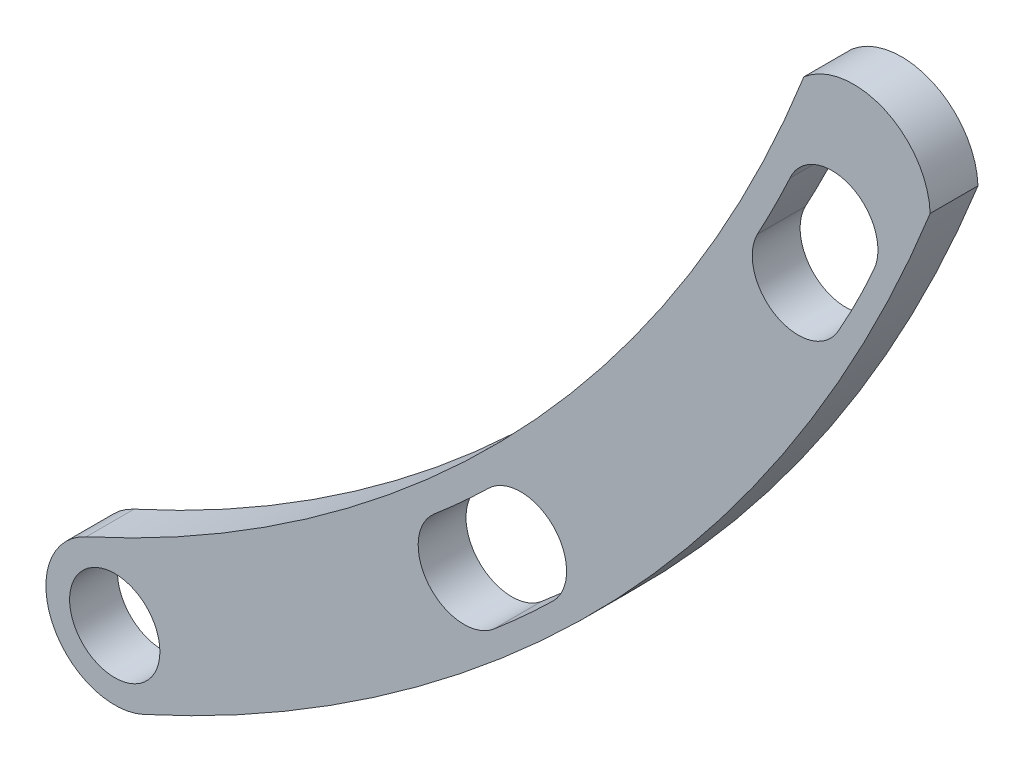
ISO-10303-21;
HEADER;
FILE_DESCRIPTION(('STEP AP214'),'2;1');
FILE_NAME('part.step','',(''),(''),'','','');
FILE_SCHEMA(('AUTOMOTIVE_DESIGN { 1 0 10303 214 1 1 1 1 }'));
ENDSEC;
DATA;
#1=APPLICATION_CONTEXT('core data for automotive mechanical design processes');
#2=APPLICATION_PROTOCOL_DEFINITION('international standard','automotive_design',2000,#1);
#3=PRODUCT_CONTEXT('',#1,'mechanical');
#4=PRODUCT('Part','Part','',(#3));
#5=PRODUCT_RELATED_PRODUCT_CATEGORY('part','',(#4));
#6=PRODUCT_DEFINITION_FORMATION('','',#4);
#7=PRODUCT_DEFINITION_CONTEXT('part definition',#1,'design');
#8=PRODUCT_DEFINITION('design','',#6,#7);
#9=PRODUCT_DEFINITION_SHAPE('','',#8);
#10=(LENGTH_UNIT() NAMED_UNIT(*) SI_UNIT(.MILLI.,.METRE.));
#11=(NAMED_UNIT(*) PLANE_ANGLE_UNIT() SI_UNIT($,.RADIAN.));
#12=(NAMED_UNIT(*) SI_UNIT($,.STERADIAN.) SOLID_ANGLE_UNIT());
#13=UNCERTAINTY_MEASURE_WITH_UNIT(LENGTH_MEASURE(1.E-05),#10,'distance_accuracy_value','');
#14=(GEOMETRIC_REPRESENTATION_CONTEXT(3) GLOBAL_UNCERTAINTY_ASSIGNED_CONTEXT((#13)) GLOBAL_UNIT_ASSIGNED_CONTEXT((#10,
#11,#12)) REPRESENTATION_CONTEXT('',''));
#15=CARTESIAN_POINT('',(0.,0.,0.));
#16=DIRECTION('',(0.,0.,1.));
#17=DIRECTION('',(1.,0.,0.));
#18=AXIS2_PLACEMENT_3D('',#15,#16,#17);
#19=CARTESIAN_POINT('',(-23.9673933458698,3.05846681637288,1.5875));
#20=DIRECTION('',(0.,0.,-1.));
#21=DIRECTION('',(-1.,0.,0.));
#22=AXIS2_PLACEMENT_3D('',#19,#20,#21);
#23=PLANE('',#22);
#24=CARTESIAN_POINT('',(9.8401518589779,4.52408077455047,1.5875));
#25=DIRECTION('',(0.,0.,1.));
#26=DIRECTION('',(-1.,0.,0.));
#27=AXIS2_PLACEMENT_3D('',#24,#25,#26);
#28=CIRCLE('',#27,1.524);
#29=CARTESIAN_POINT('',(11.2366607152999,3.91388489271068,1.5875));
#30=VERTEX_POINT('',#29);
#31=CARTESIAN_POINT('',(8.4436430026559,5.13427665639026,1.5875));
#32=VERTEX_POINT('',#31);
#33=EDGE_CURVE('E161',#30,#32,#28,.T.);
#34=ORIENTED_EDGE('',*,*,#33,.F.);
#35=CARTESIAN_POINT('',(-12.1897846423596,14.1499248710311,1.5875));
#36=DIRECTION('',(0.,0.,1.));
#37=DIRECTION('',(-1.,0.,0.));
#38=AXIS2_PLACEMENT_3D('',#35,#36,#37);
#39=CIRCLE('',#38,25.5651101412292);
#40=CARTESIAN_POINT('',(10.0424112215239,1.52834321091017,1.5875));
#41=VERTEX_POINT('',#40);
#42=EDGE_CURVE('E53',#41,#30,#39,.T.);
#43=ORIENTED_EDGE('',*,*,#42,.F.);
#44=CARTESIAN_POINT('',(8.71709455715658,2.28074718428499,1.5875));
#45=DIRECTION('',(0.,0.,1.));
#46=DIRECTION('',(-1.,0.,0.));
#47=AXIS2_PLACEMENT_3D('',#44,#45,#46);
#48=CIRCLE('',#47,1.524);
#49=CARTESIAN_POINT('',(7.36303274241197,2.98009874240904,1.5875));
#50=VERTEX_POINT('',#49);
#51=EDGE_CURVE('E169',#50,#41,#48,.T.);
#52=ORIENTED_EDGE('',*,*,#51,.F.);
#53=CARTESIAN_POINT('',(-26.1800502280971,21.1545957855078,1.5875));
#54=DIRECTION('',(0.,0.,-1.));
#55=DIRECTION('',(1.,0.,0.));
#56=AXIS2_PLACEMENT_3D('',#53,#54,#55);
#57=CIRCLE('',#56,38.1503703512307);
#58=EDGE_CURVE('E181',#32,#50,#57,.T.);
#59=ORIENTED_EDGE('',*,*,#58,.F.);
#60=EDGE_LOOP('',(#34,#43,#52,#59));
#61=FACE_BOUND('',#60,.T.);
#62=CARTESIAN_POINT('',(-2.3735252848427,-11.5836037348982,1.5875));
#63=DIRECTION('',(0.,0.,1.));
#64=DIRECTION('',(1.,0.,0.));
#65=AXIS2_PLACEMENT_3D('',#62,#63,#64);
#66=CIRCLE('',#65,1.524);
#67=CARTESIAN_POINT('',(-3.35924509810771,-10.4213075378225,1.5875));
#68=VERTEX_POINT('',#67);
#69=CARTESIAN_POINT('',(-1.3878054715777,-12.745899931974,1.5875));
#70=VERTEX_POINT('',#69);
#71=EDGE_CURVE('E209',#68,#70,#66,.T.);
#72=ORIENTED_EDGE('',*,*,#71,.F.);
#73=CARTESIAN_POINT('',(-26.2307560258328,16.5472790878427,1.5875));
#74=DIRECTION('',(0.,0.,-1.));
#75=DIRECTION('',(1.,0.,0.));
#76=AXIS2_PLACEMENT_3D('',#73,#74,#75);
#77=CIRCLE('',#76,35.3611464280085);
#78=CARTESIAN_POINT('',(-1.5580122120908,-8.78385569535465,1.5875));
#79=VERTEX_POINT('',#78);
#80=EDGE_CURVE('E188',#79,#68,#77,.T.);
#81=ORIENTED_EDGE('',*,*,#80,.F.);
#82=CARTESIAN_POINT('',(-0.494662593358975,-9.8755807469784,1.5875));
#83=DIRECTION('',(0.,0.,1.));
#84=DIRECTION('',(1.,0.,0.));
#85=AXIS2_PLACEMENT_3D('',#82,#83,#84);
#86=CIRCLE('',#85,1.524);
#87=CARTESIAN_POINT('',(0.568687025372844,-10.9673057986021,1.5875));
#88=VERTEX_POINT('',#87);
#89=EDGE_CURVE('E198',#88,#79,#86,.T.);
#90=ORIENTED_EDGE('',*,*,#89,.F.);
#91=CARTESIAN_POINT('',(-26.2307560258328,16.5472790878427,1.5875));
#92=DIRECTION('',(0.,0.,1.));
#93=DIRECTION('',(-1.,0.,0.));
#94=AXIS2_PLACEMENT_3D('',#91,#92,#93);
#95=CIRCLE('',#94,38.4091464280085);
#96=EDGE_CURVE('E212',#70,#88,#95,.T.);
#97=ORIENTED_EDGE('',*,*,#96,.F.);
#98=EDGE_LOOP('',(#72,#81,#90,#97));
#99=FACE_BOUND('',#98,.T.);
#100=CARTESIAN_POINT('',(-33.9647866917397,25.0548821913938,1.5875));
#101=DIRECTION('',(0.,0.,1.));
#102=DIRECTION('',(-1.,0.,0.));
#103=AXIS2_PLACEMENT_3D('',#100,#101,#102);
#104=CIRCLE('',#103,50.6095);
#105=CARTESIAN_POINT('',(-13.0241230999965,-21.0190811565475,1.5875));
#106=VERTEX_POINT('',#105);
#107=CARTESIAN_POINT('',(13.0991355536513,6.44551054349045,1.5875));
#108=VERTEX_POINT('',#107);
#109=EDGE_CURVE('E131',#106,#108,#104,.T.);
#110=ORIENTED_EDGE('',*,*,#109,.T.);
#111=CARTESIAN_POINT('',(10.5609319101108,6.35,1.5875));
#112=DIRECTION('',(0.,0.,1.));
#113=DIRECTION('',(1.,0.,0.));
#114=AXIS2_PLACEMENT_3D('',#111,#112,#113);
#115=CIRCLE('',#114,2.54);
#116=CARTESIAN_POINT('',(8.90679250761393,8.27754321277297,1.5875));
#117=VERTEX_POINT('',#116);
#118=EDGE_CURVE('E45',#108,#117,#115,.T.);
#119=ORIENTED_EDGE('',*,*,#118,.T.);
#120=CARTESIAN_POINT('',(-33.9647866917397,25.0548821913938,1.5875));
#121=DIRECTION('',(0.,0.,-1.));
#122=DIRECTION('',(-1.,0.,0.));
#123=AXIS2_PLACEMENT_3D('',#120,#121,#122);
#124=CIRCLE('',#123,46.0375);
#125=CARTESIAN_POINT('',(-14.9158769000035,-16.8568159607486,1.5875));
#126=VERTEX_POINT('',#125);
#127=EDGE_CURVE('E128',#117,#126,#124,.T.);
#128=ORIENTED_EDGE('',*,*,#127,.T.);
#129=CARTESIAN_POINT('',(-13.97,-18.9379485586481,1.5875));
#130=DIRECTION('',(0.,0.,1.));
#131=DIRECTION('',(1.,0.,0.));
#132=AXIS2_PLACEMENT_3D('',#129,#130,#131);
#133=CIRCLE('',#132,2.286);
#134=EDGE_CURVE('E135',#126,#106,#133,.T.);
#135=ORIENTED_EDGE('',*,*,#134,.T.);
#136=EDGE_LOOP('',(#110,#119,#128,#135));
#137=FACE_BOUND('',#136,.T.);
#138=CARTESIAN_POINT('',(-13.97,-18.9379485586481,1.5875));
#139=DIRECTION('',(0.,0.,1.));
#140=DIRECTION('',(1.,0.,0.));
#141=AXIS2_PLACEMENT_3D('',#138,#139,#140);
#142=CIRCLE('',#141,1.4986);
#143=CARTESIAN_POINT('',(-12.4714,-18.9379485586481,1.5875));
#144=VERTEX_POINT('',#143);
#145=EDGE_CURVE('E149',#144,#144,#142,.T.);
#146=ORIENTED_EDGE('',*,*,#145,.F.);
#147=EDGE_LOOP('',(#146));
#148=FACE_BOUND('',#147,.T.);
#149=ADVANCED_FACE('F30',(#61,#99,#137,#148),#23,.F.);
#150=CARTESIAN_POINT('',(-23.9673933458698,3.05846681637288,0.));
#151=DIRECTION('',(0.,0.,-1.));
#152=DIRECTION('',(-1.,0.,0.));
#153=AXIS2_PLACEMENT_3D('',#150,#151,#152);
#154=PLANE('',#153);
#155=CARTESIAN_POINT('',(10.5609319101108,6.35,0.));
#156=DIRECTION('',(0.,0.,-1.));
#157=DIRECTION('',(-1.,0.,0.));
#158=AXIS2_PLACEMENT_3D('',#155,#156,#157);
#159=CIRCLE('',#158,2.54);
#160=CARTESIAN_POINT('',(13.0991355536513,6.44551054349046,0.));
#161=VERTEX_POINT('',#160);
#162=CARTESIAN_POINT('',(8.90679250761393,8.27754321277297,0.));
#163=VERTEX_POINT('',#162);
#164=EDGE_CURVE('E120',#161,#163,#159,.F.);
#165=ORIENTED_EDGE('',*,*,#164,.F.);
#166=CARTESIAN_POINT('',(-33.9647866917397,25.0548821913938,0.));
#167=DIRECTION('',(0.,0.,1.));
#168=DIRECTION('',(-1.,0.,0.));
#169=AXIS2_PLACEMENT_3D('',#166,#167,#168);
#170=CIRCLE('',#169,50.6095);
#171=CARTESIAN_POINT('',(-13.0241230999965,-21.0190811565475,0.));
#172=VERTEX_POINT('',#171);
#173=EDGE_CURVE('E136',#172,#161,#170,.T.);
#174=ORIENTED_EDGE('',*,*,#173,.F.);
#175=CARTESIAN_POINT('',(-13.97,-18.9379485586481,0.));
#176=DIRECTION('',(0.,0.,1.));
#177=DIRECTION('',(1.,0.,0.));
#178=AXIS2_PLACEMENT_3D('',#175,#176,#177);
#179=CIRCLE('',#178,2.286);
#180=CARTESIAN_POINT('',(-14.9158769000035,-16.8568159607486,0.));
#181=VERTEX_POINT('',#180);
#182=EDGE_CURVE('E140',#181,#172,#179,.T.);
#183=ORIENTED_EDGE('',*,*,#182,.F.);
#184=CARTESIAN_POINT('',(-33.9647866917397,25.0548821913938,0.));
#185=DIRECTION('',(0.,0.,-1.));
#186=DIRECTION('',(-1.,0.,0.));
#187=AXIS2_PLACEMENT_3D('',#184,#185,#186);
#188=CIRCLE('',#187,46.0375);
#189=EDGE_CURVE('E147',#163,#181,#188,.T.);
#190=ORIENTED_EDGE('',*,*,#189,.F.);
#191=EDGE_LOOP('',(#165,#174,#183,#190));
#192=FACE_BOUND('',#191,.T.);
#193=CARTESIAN_POINT('',(-12.1897846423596,14.1499248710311,0.));
#194=DIRECTION('',(0.,0.,1.));
#195=DIRECTION('',(-1.,0.,0.));
#196=AXIS2_PLACEMENT_3D('',#193,#194,#195);
#197=CIRCLE('',#196,25.5651101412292);
#198=CARTESIAN_POINT('',(10.0424112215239,1.52834321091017,0.));
#199=VERTEX_POINT('',#198);
#200=CARTESIAN_POINT('',(11.2366607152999,3.91388489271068,0.));
#201=VERTEX_POINT('',#200);
#202=EDGE_CURVE('E165',#199,#201,#197,.T.);
#203=ORIENTED_EDGE('',*,*,#202,.T.);
#204=CARTESIAN_POINT('',(9.8401518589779,4.52408077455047,0.));
#205=DIRECTION('',(0.,0.,1.));
#206=DIRECTION('',(-1.,0.,0.));
#207=AXIS2_PLACEMENT_3D('',#204,#205,#206);
#208=CIRCLE('',#207,1.524);
#209=CARTESIAN_POINT('',(8.4436430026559,5.13427665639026,0.));
#210=VERTEX_POINT('',#209);
#211=EDGE_CURVE('E168',#201,#210,#208,.T.);
#212=ORIENTED_EDGE('',*,*,#211,.T.);
#213=CARTESIAN_POINT('',(-26.1800502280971,21.1545957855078,0.));
#214=DIRECTION('',(0.,0.,-1.));
#215=DIRECTION('',(1.,0.,0.));
#216=AXIS2_PLACEMENT_3D('',#213,#214,#215);
#217=CIRCLE('',#216,38.1503703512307);
#218=CARTESIAN_POINT('',(7.36303274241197,2.98009874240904,0.));
#219=VERTEX_POINT('',#218);
#220=EDGE_CURVE('E172',#210,#219,#217,.T.);
#221=ORIENTED_EDGE('',*,*,#220,.T.);
#222=CARTESIAN_POINT('',(8.71709455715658,2.28074718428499,0.));
#223=DIRECTION('',(0.,0.,1.));
#224=DIRECTION('',(-1.,0.,0.));
#225=AXIS2_PLACEMENT_3D('',#222,#223,#224);
#226=CIRCLE('',#225,1.524);
#227=EDGE_CURVE('E175',#219,#199,#226,.T.);
#228=ORIENTED_EDGE('',*,*,#227,.T.);
#229=EDGE_LOOP('',(#203,#212,#221,#228));
#230=FACE_BOUND('',#229,.T.);
#231=CARTESIAN_POINT('',(-26.2307560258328,16.5472790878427,0.));
#232=DIRECTION('',(0.,0.,-1.));
#233=DIRECTION('',(1.,0.,0.));
#234=AXIS2_PLACEMENT_3D('',#231,#232,#233);
#235=CIRCLE('',#234,35.3611464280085);
#236=CARTESIAN_POINT('',(-1.5580122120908,-8.78385569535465,0.));
#237=VERTEX_POINT('',#236);
#238=CARTESIAN_POINT('',(-3.35924509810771,-10.4213075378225,0.));
#239=VERTEX_POINT('',#238);
#240=EDGE_CURVE('E194',#237,#239,#235,.T.);
#241=ORIENTED_EDGE('',*,*,#240,.T.);
#242=CARTESIAN_POINT('',(-2.3735252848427,-11.5836037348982,0.));
#243=DIRECTION('',(0.,0.,1.));
#244=DIRECTION('',(1.,0.,0.));
#245=AXIS2_PLACEMENT_3D('',#242,#243,#244);
#246=CIRCLE('',#245,1.524);
#247=CARTESIAN_POINT('',(-1.3878054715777,-12.745899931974,0.));
#248=VERTEX_POINT('',#247);
#249=EDGE_CURVE('E197',#239,#248,#246,.T.);
#250=ORIENTED_EDGE('',*,*,#249,.T.);
#251=CARTESIAN_POINT('',(-26.2307560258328,16.5472790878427,0.));
#252=DIRECTION('',(0.,0.,1.));
#253=DIRECTION('',(-1.,0.,0.));
#254=AXIS2_PLACEMENT_3D('',#251,#252,#253);
#255=CIRCLE('',#254,38.4091464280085);
#256=CARTESIAN_POINT('',(0.568687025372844,-10.9673057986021,0.));
#257=VERTEX_POINT('',#256);
#258=EDGE_CURVE('E201',#248,#257,#255,.T.);
#259=ORIENTED_EDGE('',*,*,#258,.T.);
#260=CARTESIAN_POINT('',(-0.494662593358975,-9.8755807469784,0.));
#261=DIRECTION('',(0.,0.,1.));
#262=DIRECTION('',(1.,0.,0.));
#263=AXIS2_PLACEMENT_3D('',#260,#261,#262);
#264=CIRCLE('',#263,1.524);
#265=EDGE_CURVE('E204',#257,#237,#264,.T.);
#266=ORIENTED_EDGE('',*,*,#265,.T.);
#267=EDGE_LOOP('',(#241,#250,#259,#266));
#268=FACE_BOUND('',#267,.T.);
#269=CARTESIAN_POINT('',(-13.97,-18.9379485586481,0.));
#270=DIRECTION('',(0.,0.,1.));
#271=DIRECTION('',(1.,0.,0.));
#272=AXIS2_PLACEMENT_3D('',#269,#270,#271);
#273=CIRCLE('',#272,1.4986);
#274=CARTESIAN_POINT('',(-12.4714,-18.9379485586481,0.));
#275=VERTEX_POINT('',#274);
#276=EDGE_CURVE('E143',#275,#275,#273,.T.);
#277=ORIENTED_EDGE('',*,*,#276,.T.);
#278=EDGE_LOOP('',(#277));
#279=FACE_BOUND('',#278,.T.);
#280=ADVANCED_FACE('F158',(#192,#230,#268,#279),#154,.T.);
#281=CARTESIAN_POINT('',(-33.9647866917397,25.0548821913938,1.5875));
#282=DIRECTION('',(0.,0.,-1.));
#283=DIRECTION('',(-1.,0.,0.));
#284=AXIS2_PLACEMENT_3D('',#281,#282,#283);
#285=CYLINDRICAL_SURFACE('',#284,46.0375);
#286=ORIENTED_EDGE('',*,*,#127,.F.);
#287=DIRECTION('',(0.,0.,-1.));
#288=VECTOR('',#287,1.);
#289=CARTESIAN_POINT('',(8.90679250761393,8.27754321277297,1.5875));
#290=LINE('',#289,#288);
#291=EDGE_CURVE('E117',#117,#163,#290,.T.);
#292=ORIENTED_EDGE('',*,*,#291,.T.);
#293=ORIENTED_EDGE('',*,*,#189,.T.);
#294=DIRECTION('',(0.,0.,-1.));
#295=VECTOR('',#294,1.);
#296=CARTESIAN_POINT('',(-14.9158769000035,-16.8568159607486,1.5875));
#297=LINE('',#296,#295);
#298=EDGE_CURVE('E11',#126,#181,#297,.T.);
#299=ORIENTED_EDGE('',*,*,#298,.F.);
#300=EDGE_LOOP('',(#286,#292,#293,#299));
#301=FACE_BOUND('',#300,.T.);
#302=ADVANCED_FACE('F32',(#301),#285,.F.);
#303=CARTESIAN_POINT('',(-13.97,-18.9379485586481,1.5875));
#304=DIRECTION('',(0.,0.,-1.));
#305=DIRECTION('',(-1.,0.,0.));
#306=AXIS2_PLACEMENT_3D('',#303,#304,#305);
#307=CYLINDRICAL_SURFACE('',#306,2.286);
#308=ORIENTED_EDGE('',*,*,#182,.T.);
#309=DIRECTION('',(0.,0.,-1.));
#310=VECTOR('',#309,1.);
#311=CARTESIAN_POINT('',(-13.0241230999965,-21.0190811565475,1.5875));
#312=LINE('',#311,#310);
#313=EDGE_CURVE('E38',#106,#172,#312,.T.);
#314=ORIENTED_EDGE('',*,*,#313,.F.);
#315=ORIENTED_EDGE('',*,*,#134,.F.);
#316=ORIENTED_EDGE('',*,*,#298,.T.);
#317=EDGE_LOOP('',(#308,#314,#315,#316));
#318=FACE_BOUND('',#317,.T.);
#319=ADVANCED_FACE('F242',(#318),#307,.T.);
#320=CARTESIAN_POINT('',(-33.9647866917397,25.0548821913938,1.5875));
#321=DIRECTION('',(0.,0.,-1.));
#322=DIRECTION('',(-1.,0.,0.));
#323=AXIS2_PLACEMENT_3D('',#320,#321,#322);
#324=CYLINDRICAL_SURFACE('',#323,50.6095);
#325=ORIENTED_EDGE('',*,*,#173,.T.);
#326=DIRECTION('',(0.,0.,-1.));
#327=VECTOR('',#326,1.);
#328=CARTESIAN_POINT('',(13.0991355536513,6.44551054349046,1.5875));
#329=LINE('',#328,#327);
#330=EDGE_CURVE('E132',#108,#161,#329,.T.);
#331=ORIENTED_EDGE('',*,*,#330,.F.);
#332=ORIENTED_EDGE('',*,*,#109,.F.);
#333=ORIENTED_EDGE('',*,*,#313,.T.);
#334=EDGE_LOOP('',(#325,#331,#332,#333));
#335=FACE_BOUND('',#334,.T.);
#336=ADVANCED_FACE('F154',(#335),#324,.T.);
#337=CARTESIAN_POINT('',(-13.97,-18.9379485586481,1.5875));
#338=DIRECTION('',(0.,0.,-1.));
#339=DIRECTION('',(-1.,0.,0.));
#340=AXIS2_PLACEMENT_3D('',#337,#338,#339);
#341=CYLINDRICAL_SURFACE('',#340,1.4986);
#342=ORIENTED_EDGE('',*,*,#145,.T.);
#343=EDGE_LOOP('',(#342));
#344=FACE_BOUND('',#343,.T.);
#345=ORIENTED_EDGE('',*,*,#276,.F.);
#346=EDGE_LOOP('',(#345));
#347=FACE_BOUND('',#346,.T.);
#348=ADVANCED_FACE('F231',(#344,#347),#341,.F.);
#349=CARTESIAN_POINT('',(-26.2307560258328,16.5472790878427,0.));
#350=DIRECTION('',(0.,0.,1.));
#351=DIRECTION('',(1.,0.,0.));
#352=AXIS2_PLACEMENT_3D('',#349,#350,#351);
#353=CYLINDRICAL_SURFACE('',#352,35.3611464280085);
#354=ORIENTED_EDGE('',*,*,#80,.T.);
#355=DIRECTION('',(0.,0.,1.));
#356=VECTOR('',#355,1.);
#357=CARTESIAN_POINT('',(-3.35924509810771,-10.4213075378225,0.));
#358=LINE('',#357,#356);
#359=EDGE_CURVE('E207',#239,#68,#358,.T.);
#360=ORIENTED_EDGE('',*,*,#359,.F.);
#361=ORIENTED_EDGE('',*,*,#240,.F.);
#362=DIRECTION('',(0.,0.,1.));
#363=VECTOR('',#362,1.);
#364=CARTESIAN_POINT('',(-1.5580122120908,-8.78385569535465,0.));
#365=LINE('',#364,#363);
#366=EDGE_CURVE('E217',#237,#79,#365,.T.);
#367=ORIENTED_EDGE('',*,*,#366,.T.);
#368=EDGE_LOOP('',(#354,#360,#361,#367));
#369=FACE_BOUND('',#368,.T.);
#370=ADVANCED_FACE('F233',(#369),#353,.T.);
#371=CARTESIAN_POINT('',(-0.494662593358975,-9.8755807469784,0.));
#372=DIRECTION('',(0.,0.,1.));
#373=DIRECTION('',(1.,0.,0.));
#374=AXIS2_PLACEMENT_3D('',#371,#372,#373);
#375=CYLINDRICAL_SURFACE('',#374,1.524);
#376=ORIENTED_EDGE('',*,*,#89,.T.);
#377=ORIENTED_EDGE('',*,*,#366,.F.);
#378=ORIENTED_EDGE('',*,*,#265,.F.);
#379=DIRECTION('',(0.,0.,1.));
#380=VECTOR('',#379,1.);
#381=CARTESIAN_POINT('',(0.568687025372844,-10.9673057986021,0.));
#382=LINE('',#381,#380);
#383=EDGE_CURVE('E219',#257,#88,#382,.T.);
#384=ORIENTED_EDGE('',*,*,#383,.T.);
#385=EDGE_LOOP('',(#376,#377,#378,#384));
#386=FACE_BOUND('',#385,.T.);
#387=ADVANCED_FACE('F239',(#386),#375,.F.);
#388=CARTESIAN_POINT('',(-26.2307560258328,16.5472790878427,0.));
#389=DIRECTION('',(0.,0.,1.));
#390=DIRECTION('',(1.,0.,0.));
#391=AXIS2_PLACEMENT_3D('',#388,#389,#390);
#392=CYLINDRICAL_SURFACE('',#391,38.4091464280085);
#393=ORIENTED_EDGE('',*,*,#96,.T.);
#394=ORIENTED_EDGE('',*,*,#383,.F.);
#395=ORIENTED_EDGE('',*,*,#258,.F.);
#396=DIRECTION('',(0.,0.,1.));
#397=VECTOR('',#396,1.);
#398=CARTESIAN_POINT('',(-1.3878054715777,-12.745899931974,0.));
#399=LINE('',#398,#397);
#400=EDGE_CURVE('E221',#248,#70,#399,.T.);
#401=ORIENTED_EDGE('',*,*,#400,.T.);
#402=EDGE_LOOP('',(#393,#394,#395,#401));
#403=FACE_BOUND('',#402,.T.);
#404=ADVANCED_FACE('F319',(#403),#392,.F.);
#405=CARTESIAN_POINT('',(-2.3735252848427,-11.5836037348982,0.));
#406=DIRECTION('',(0.,0.,1.));
#407=DIRECTION('',(1.,0.,0.));
#408=AXIS2_PLACEMENT_3D('',#405,#406,#407);
#409=CYLINDRICAL_SURFACE('',#408,1.524);
#410=ORIENTED_EDGE('',*,*,#71,.T.);
#411=ORIENTED_EDGE('',*,*,#400,.F.);
#412=ORIENTED_EDGE('',*,*,#249,.F.);
#413=ORIENTED_EDGE('',*,*,#359,.T.);
#414=EDGE_LOOP('',(#410,#411,#412,#413));
#415=FACE_BOUND('',#414,.T.);
#416=ADVANCED_FACE('F310',(#415),#409,.F.);
#417=CARTESIAN_POINT('',(-12.1897846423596,14.1499248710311,0.));
#418=DIRECTION('',(0.,0.,1.));
#419=DIRECTION('',(1.,0.,0.));
#420=AXIS2_PLACEMENT_3D('',#417,#418,#419);
#421=CYLINDRICAL_SURFACE('',#420,25.5651101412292);
#422=ORIENTED_EDGE('',*,*,#42,.T.);
#423=DIRECTION('',(0.,0.,1.));
#424=VECTOR('',#423,1.);
#425=CARTESIAN_POINT('',(11.2366607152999,3.91388489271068,0.));
#426=LINE('',#425,#424);
#427=EDGE_CURVE('E177',#201,#30,#426,.T.);
#428=ORIENTED_EDGE('',*,*,#427,.F.);
#429=ORIENTED_EDGE('',*,*,#202,.F.);
#430=DIRECTION('',(0.,0.,1.));
#431=VECTOR('',#430,1.);
#432=CARTESIAN_POINT('',(10.0424112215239,1.52834321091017,0.));
#433=LINE('',#432,#431);
#434=EDGE_CURVE('E186',#199,#41,#433,.T.);
#435=ORIENTED_EDGE('',*,*,#434,.T.);
#436=EDGE_LOOP('',(#422,#428,#429,#435));
#437=FACE_BOUND('',#436,.T.);
#438=ADVANCED_FACE('F300',(#437),#421,.F.);
#439=CARTESIAN_POINT('',(8.71709455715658,2.28074718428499,0.));
#440=DIRECTION('',(0.,0.,1.));
#441=DIRECTION('',(1.,0.,0.));
#442=AXIS2_PLACEMENT_3D('',#439,#440,#441);
#443=CYLINDRICAL_SURFACE('',#442,1.524);
#444=ORIENTED_EDGE('',*,*,#51,.T.);
#445=ORIENTED_EDGE('',*,*,#434,.F.);
#446=ORIENTED_EDGE('',*,*,#227,.F.);
#447=DIRECTION('',(0.,0.,1.));
#448=VECTOR('',#447,1.);
#449=CARTESIAN_POINT('',(7.36303274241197,2.98009874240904,0.));
#450=LINE('',#449,#448);
#451=EDGE_CURVE('E189',#219,#50,#450,.T.);
#452=ORIENTED_EDGE('',*,*,#451,.T.);
#453=EDGE_LOOP('',(#444,#445,#446,#452));
#454=FACE_BOUND('',#453,.T.);
#455=ADVANCED_FACE('F290',(#454),#443,.F.);
#456=CARTESIAN_POINT('',(-26.1800502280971,21.1545957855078,0.));
#457=DIRECTION('',(0.,0.,1.));
#458=DIRECTION('',(1.,0.,0.));
#459=AXIS2_PLACEMENT_3D('',#456,#457,#458);
#460=CYLINDRICAL_SURFACE('',#459,38.1503703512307);
#461=ORIENTED_EDGE('',*,*,#58,.T.);
#462=ORIENTED_EDGE('',*,*,#451,.F.);
#463=ORIENTED_EDGE('',*,*,#220,.F.);
#464=DIRECTION('',(0.,0.,1.));
#465=VECTOR('',#464,1.);
#466=CARTESIAN_POINT('',(8.4436430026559,5.13427665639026,0.));
#467=LINE('',#466,#465);
#468=EDGE_CURVE('E191',#210,#32,#467,.T.);
#469=ORIENTED_EDGE('',*,*,#468,.T.);
#470=EDGE_LOOP('',(#461,#462,#463,#469));
#471=FACE_BOUND('',#470,.T.);
#472=ADVANCED_FACE('F278',(#471),#460,.T.);
#473=CARTESIAN_POINT('',(9.8401518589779,4.52408077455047,0.));
#474=DIRECTION('',(0.,0.,1.));
#475=DIRECTION('',(1.,0.,0.));
#476=AXIS2_PLACEMENT_3D('',#473,#474,#475);
#477=CYLINDRICAL_SURFACE('',#476,1.524);
#478=ORIENTED_EDGE('',*,*,#33,.T.);
#479=ORIENTED_EDGE('',*,*,#468,.F.);
#480=ORIENTED_EDGE('',*,*,#211,.F.);
#481=ORIENTED_EDGE('',*,*,#427,.T.);
#482=EDGE_LOOP('',(#478,#479,#480,#481));
#483=FACE_BOUND('',#482,.T.);
#484=ADVANCED_FACE('F273',(#483),#477,.F.);
#485=CARTESIAN_POINT('',(10.5609319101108,6.35,1.5875));
#486=DIRECTION('',(0.,0.,-1.));
#487=DIRECTION('',(-1.,0.,0.));
#488=AXIS2_PLACEMENT_3D('',#485,#486,#487);
#489=CYLINDRICAL_SURFACE('',#488,2.54);
#490=ORIENTED_EDGE('',*,*,#330,.T.);
#491=ORIENTED_EDGE('',*,*,#164,.T.);
#492=ORIENTED_EDGE('',*,*,#291,.F.);
#493=ORIENTED_EDGE('',*,*,#118,.F.);
#494=EDGE_LOOP('',(#490,#491,#492,#493));
#495=FACE_BOUND('',#494,.T.);
#496=ADVANCED_FACE('F118',(#495),#489,.T.);
#497=CLOSED_SHELL('',(#149,#280,#302,#319,#336,#348,#370,#387,#404,#416,#438,#455,#472,#484,#496));
#498=MANIFOLD_SOLID_BREP('B2',#497);
#499=ADVANCED_BREP_SHAPE_REPRESENTATION('',(#18,#498),#14);
#500=SHAPE_DEFINITION_REPRESENTATION(#9,#499);
ENDSEC;
END-ISO-10303-21;
